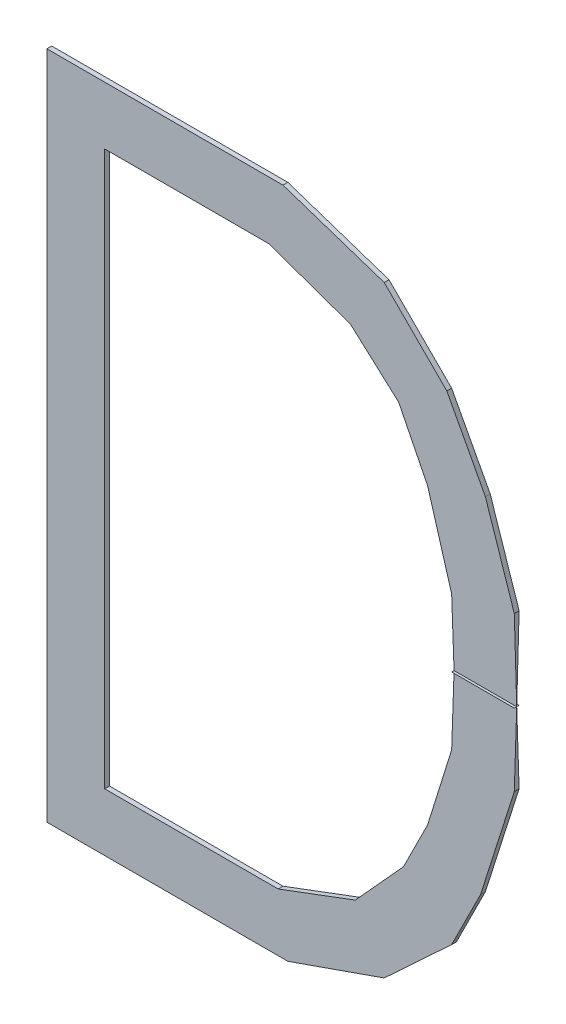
ISO-10303-21;
HEADER;
FILE_DESCRIPTION(('STEP AP214'),'2;1');
FILE_NAME('part.step','',(''),(''),'','','');
FILE_SCHEMA(('AUTOMOTIVE_DESIGN { 1 0 10303 214 1 1 1 1 }'));
ENDSEC;
DATA;
#1=APPLICATION_CONTEXT('core data for automotive mechanical design processes');
#2=APPLICATION_PROTOCOL_DEFINITION('international standard','automotive_design',2000,#1);
#3=PRODUCT_CONTEXT('',#1,'mechanical');
#4=PRODUCT('Part','Part','',(#3));
#5=PRODUCT_RELATED_PRODUCT_CATEGORY('part','',(#4));
#6=PRODUCT_DEFINITION_FORMATION('','',#4);
#7=PRODUCT_DEFINITION_CONTEXT('part definition',#1,'design');
#8=PRODUCT_DEFINITION('design','',#6,#7);
#9=PRODUCT_DEFINITION_SHAPE('','',#8);
#10=(LENGTH_UNIT() NAMED_UNIT(*) SI_UNIT(.MILLI.,.METRE.));
#11=(NAMED_UNIT(*) PLANE_ANGLE_UNIT() SI_UNIT($,.RADIAN.));
#12=(NAMED_UNIT(*) SI_UNIT($,.STERADIAN.) SOLID_ANGLE_UNIT());
#13=UNCERTAINTY_MEASURE_WITH_UNIT(LENGTH_MEASURE(1.E-05),#10,'distance_accuracy_value','');
#14=(GEOMETRIC_REPRESENTATION_CONTEXT(3) GLOBAL_UNCERTAINTY_ASSIGNED_CONTEXT((#13)) GLOBAL_UNIT_ASSIGNED_CONTEXT((#10,
#11,#12)) REPRESENTATION_CONTEXT('',''));
#15=CARTESIAN_POINT('',(0.,0.,0.));
#16=DIRECTION('',(0.,0.,1.));
#17=DIRECTION('',(1.,0.,0.));
#18=AXIS2_PLACEMENT_3D('',#15,#16,#17);
#19=CARTESIAN_POINT('',(-0.4850003,-0.69499988,0.01));
#20=DIRECTION('',(0.,0.,1.));
#21=DIRECTION('',(1.,0.,0.));
#22=AXIS2_PLACEMENT_3D('',#19,#20,#21);
#23=PLANE('',#22);
#24=DIRECTION('',(0.447213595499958,0.894427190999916,0.));
#25=VECTOR('',#24,1.);
#26=CARTESIAN_POINT('',(0.35500056,-0.49500028,0.01));
#27=LINE('',#26,#25);
#28=CARTESIAN_POINT('',(0.35500056,-0.49500028,0.01));
#29=VERTEX_POINT('',#28);
#30=CARTESIAN_POINT('',(0.415000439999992,-0.375000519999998,0.01));
#31=VERTEX_POINT('',#30);
#32=EDGE_CURVE('P0_E373',#29,#31,#27,.T.);
#33=ORIENTED_EDGE('',*,*,#32,.T.);
#34=DIRECTION('',(0.303203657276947,0.952925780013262,0.));
#35=VECTOR('',#34,1.);
#36=CARTESIAN_POINT('',(0.41500044,-0.37500052,0.01));
#37=LINE('',#36,#35);
#38=CARTESIAN_POINT('',(0.4850003,-0.15500096,0.01));
#39=VERTEX_POINT('',#38);
#40=EDGE_CURVE('P0_E369',#31,#39,#37,.T.);
#41=ORIENTED_EDGE('',*,*,#40,.T.);
#42=DIRECTION('',(0.,1.,0.));
#43=VECTOR('',#42,1.);
#44=CARTESIAN_POINT('',(0.4850003,-0.00500126,0.01));
#45=LINE('',#44,#43);
#46=CARTESIAN_POINT('',(0.4850003,-0.00500125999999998,0.005));
#47=VERTEX_POINT('',#46);
#48=EDGE_CURVE('P0_E224',#47,#39,#45,.F.);
#49=ORIENTED_EDGE('',*,*,#48,.F.);
#50=DIRECTION('',(0.,1.,0.));
#51=VECTOR('',#50,1.);
#52=CARTESIAN_POINT('',(0.4850003,0.1649984,0.01));
#53=LINE('',#52,#51);
#54=CARTESIAN_POINT('',(0.485000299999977,0.164998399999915,0.01));
#55=VERTEX_POINT('',#54);
#56=EDGE_CURVE('P0_E343',#55,#47,#53,.F.);
#57=ORIENTED_EDGE('',*,*,#56,.F.);
#58=DIRECTION('',(-0.316223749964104,0.948684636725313,0.));
#59=VECTOR('',#58,1.);
#60=CARTESIAN_POINT('',(0.42500042,0.34500058,0.01));
#61=LINE('',#60,#59);
#62=CARTESIAN_POINT('',(0.42500041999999,0.345000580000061,0.01));
#63=VERTEX_POINT('',#62);
#64=EDGE_CURVE('P0_E221',#63,#55,#61,.F.);
#65=ORIENTED_EDGE('',*,*,#64,.F.);
#66=DIRECTION('',(-0.470588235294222,0.882352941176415,0.));
#67=VECTOR('',#66,1.);
#68=CARTESIAN_POINT('',(0.34500058,0.49500028,0.01));
#69=LINE('',#68,#67);
#70=CARTESIAN_POINT('',(0.34500058,0.49500028,0.01));
#71=VERTEX_POINT('',#70);
#72=EDGE_CURVE('P0_E218',#71,#63,#69,.F.);
#73=ORIENTED_EDGE('',*,*,#72,.F.);
#74=DIRECTION('',(-0.707106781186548,0.707106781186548,0.));
#75=VECTOR('',#74,1.);
#76=CARTESIAN_POINT('',(0.21500084,0.62500002,0.01));
#77=LINE('',#76,#75);
#78=CARTESIAN_POINT('',(0.21500084,0.62500002,0.01));
#79=VERTEX_POINT('',#78);
#80=EDGE_CURVE('P0_E215',#79,#71,#77,.F.);
#81=ORIENTED_EDGE('',*,*,#80,.F.);
#82=DIRECTION('',(-0.948683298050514,0.316227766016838,0.));
#83=VECTOR('',#82,1.);
#84=CARTESIAN_POINT('',(0.00500126,0.69499988,0.01));
#85=LINE('',#84,#83);
#86=CARTESIAN_POINT('',(0.00500125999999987,0.69499988,0.01));
#87=VERTEX_POINT('',#86);
#88=EDGE_CURVE('P0_E212',#87,#79,#85,.F.);
#89=ORIENTED_EDGE('',*,*,#88,.F.);
#90=DIRECTION('',(1.,0.,0.));
#91=VECTOR('',#90,1.);
#92=CARTESIAN_POINT('',(-0.4850003,0.69499988,0.01));
#93=LINE('',#92,#91);
#94=CARTESIAN_POINT('',(-0.4850003,0.69499988,0.01));
#95=VERTEX_POINT('',#94);
#96=EDGE_CURVE('P0_E193',#95,#87,#93,.T.);
#97=ORIENTED_EDGE('',*,*,#96,.F.);
#98=DIRECTION('',(0.,1.,0.));
#99=VECTOR('',#98,1.);
#100=CARTESIAN_POINT('',(-0.4850003,-0.69499988,0.01));
#101=LINE('',#100,#99);
#102=CARTESIAN_POINT('',(-0.4850003,-0.69499988,0.01));
#103=VERTEX_POINT('',#102);
#104=EDGE_CURVE('P0_E190',#103,#95,#101,.T.);
#105=ORIENTED_EDGE('',*,*,#104,.F.);
#106=DIRECTION('',(1.,0.,0.));
#107=VECTOR('',#106,1.);
#108=CARTESIAN_POINT('',(-0.4850003,-0.69499988,0.01));
#109=LINE('',#108,#107);
#110=CARTESIAN_POINT('',(0.0150012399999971,-0.694999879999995,0.01));
#111=VERTEX_POINT('',#110);
#112=EDGE_CURVE('P0_E20',#103,#111,#109,.T.);
#113=ORIENTED_EDGE('',*,*,#112,.T.);
#114=DIRECTION('',(0.943858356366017,0.330350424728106,0.));
#115=VECTOR('',#114,1.);
#116=CARTESIAN_POINT('',(0.01500124,-0.69499988,0.01));
#117=LINE('',#116,#115);
#118=CARTESIAN_POINT('',(0.21500084,-0.62500002,0.01));
#119=VERTEX_POINT('',#118);
#120=EDGE_CURVE('P0_E188',#111,#119,#117,.T.);
#121=ORIENTED_EDGE('',*,*,#120,.T.);
#122=DIRECTION('',(0.732793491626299,0.680451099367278,0.));
#123=VECTOR('',#122,1.);
#124=CARTESIAN_POINT('',(0.21500084,-0.62500002,0.01));
#125=LINE('',#124,#123);
#126=EDGE_CURVE('P0_E375',#119,#29,#125,.T.);
#127=ORIENTED_EDGE('',*,*,#126,.T.);
#128=EDGE_LOOP('',(#33,#41,#49,#57,#65,#73,#81,#89,#97,#105,#113,#121,#127));
#129=FACE_BOUND('',#128,.T.);
#130=DIRECTION('',(0.282162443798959,-0.95936664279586,0.));
#131=VECTOR('',#130,1.);
#132=CARTESIAN_POINT('',(0.35500056,0.13499846,0.01));
#133=LINE('',#132,#131);
#134=CARTESIAN_POINT('',(0.35500056,0.13499846,0.01));
#135=VERTEX_POINT('',#134);
#136=CARTESIAN_POINT('',(0.305000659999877,0.305000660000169,0.01));
#137=VERTEX_POINT('',#136);
#138=EDGE_CURVE('P0_E228',#135,#137,#133,.F.);
#139=ORIENTED_EDGE('',*,*,#138,.F.);
#140=DIRECTION('',(0.,1.,0.));
#141=VECTOR('',#140,1.);
#142=CARTESIAN_POINT('',(0.35500056,-0.00500126,0.01));
#143=LINE('',#142,#141);
#144=CARTESIAN_POINT('',(0.35500056,-0.00500125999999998,0.005));
#145=VERTEX_POINT('',#144);
#146=EDGE_CURVE('P0_E225',#145,#135,#143,.T.);
#147=ORIENTED_EDGE('',*,*,#146,.F.);
#148=DIRECTION('',(0.,1.,0.));
#149=VECTOR('',#148,1.);
#150=CARTESIAN_POINT('',(0.35500056,-0.14500098,0.01));
#151=LINE('',#150,#149);
#152=CARTESIAN_POINT('',(0.355000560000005,-0.145000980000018,0.01));
#153=VERTEX_POINT('',#152);
#154=EDGE_CURVE('P0_E366',#153,#145,#151,.T.);
#155=ORIENTED_EDGE('',*,*,#154,.F.);
#156=DIRECTION('',(-0.298274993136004,-0.954479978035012,0.));
#157=VECTOR('',#156,1.);
#158=CARTESIAN_POINT('',(0.30500066,-0.30500066,0.01));
#159=LINE('',#158,#157);
#160=CARTESIAN_POINT('',(0.30500066,-0.30500066,0.01));
#161=VERTEX_POINT('',#160);
#162=EDGE_CURVE('P0_E257',#161,#153,#159,.F.);
#163=ORIENTED_EDGE('',*,*,#162,.F.);
#164=DIRECTION('',(-0.447213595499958,-0.894427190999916,0.));
#165=VECTOR('',#164,1.);
#166=CARTESIAN_POINT('',(0.25500076,-0.40500046,0.01));
#167=LINE('',#166,#165);
#168=CARTESIAN_POINT('',(0.255000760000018,-0.405000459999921,0.01));
#169=VERTEX_POINT('',#168);
#170=EDGE_CURVE('P0_E255',#169,#161,#167,.F.);
#171=ORIENTED_EDGE('',*,*,#170,.F.);
#172=DIRECTION('',(-0.672672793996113,-0.739940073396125,0.));
#173=VECTOR('',#172,1.);
#174=CARTESIAN_POINT('',(0.15500096,-0.51500024,0.01));
#175=LINE('',#174,#173);
#176=CARTESIAN_POINT('',(0.155000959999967,-0.515000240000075,0.01));
#177=VERTEX_POINT('',#176);
#178=EDGE_CURVE('P0_E252',#177,#169,#175,.F.);
#179=ORIENTED_EDGE('',*,*,#178,.F.);
#180=DIRECTION('',(-0.936329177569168,-0.351123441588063,0.));
#181=VECTOR('',#180,1.);
#182=CARTESIAN_POINT('',(-0.004998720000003,-0.57500012,0.01));
#183=LINE('',#182,#181);
#184=CARTESIAN_POINT('',(-0.00499872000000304,-0.57500012,0.01));
#185=VERTEX_POINT('',#184);
#186=EDGE_CURVE('P0_E249',#185,#177,#183,.F.);
#187=ORIENTED_EDGE('',*,*,#186,.F.);
#188=DIRECTION('',(1.,0.,0.));
#189=VECTOR('',#188,1.);
#190=CARTESIAN_POINT('',(-0.36500054,-0.57500012,0.01));
#191=LINE('',#190,#189);
#192=CARTESIAN_POINT('',(-0.36500054,-0.57500012,0.01));
#193=VERTEX_POINT('',#192);
#194=EDGE_CURVE('P0_E246',#193,#185,#191,.T.);
#195=ORIENTED_EDGE('',*,*,#194,.F.);
#196=DIRECTION('',(0.,1.,0.));
#197=VECTOR('',#196,1.);
#198=CARTESIAN_POINT('',(-0.36500054,0.57500012,0.01));
#199=LINE('',#198,#197);
#200=CARTESIAN_POINT('',(-0.36500054,0.57500012,0.01));
#201=VERTEX_POINT('',#200);
#202=EDGE_CURVE('P0_E243',#201,#193,#199,.F.);
#203=ORIENTED_EDGE('',*,*,#202,.F.);
#204=DIRECTION('',(1.,0.,0.));
#205=VECTOR('',#204,1.);
#206=CARTESIAN_POINT('',(-0.02499868,0.57500012,0.01));
#207=LINE('',#206,#205);
#208=CARTESIAN_POINT('',(-0.0249986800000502,0.575000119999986,0.01));
#209=VERTEX_POINT('',#208);
#210=EDGE_CURVE('P0_E240',#209,#201,#207,.F.);
#211=ORIENTED_EDGE('',*,*,#210,.F.);
#212=DIRECTION('',(0.942990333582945,-0.332820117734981,0.));
#213=VECTOR('',#212,1.);
#214=CARTESIAN_POINT('',(0.14500098,0.51500024,0.01));
#215=LINE('',#214,#213);
#216=CARTESIAN_POINT('',(0.145000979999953,0.515000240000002,0.01));
#217=VERTEX_POINT('',#216);
#218=EDGE_CURVE('P0_E237',#217,#209,#215,.F.);
#219=ORIENTED_EDGE('',*,*,#218,.F.);
#220=DIRECTION('',(0.743294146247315,-0.668964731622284,0.));
#221=VECTOR('',#220,1.);
#222=CARTESIAN_POINT('',(0.24500078,0.42500042,0.01));
#223=LINE('',#222,#221);
#224=CARTESIAN_POINT('',(0.24500078,0.42500042,0.01));
#225=VERTEX_POINT('',#224);
#226=EDGE_CURVE('P0_E234',#225,#217,#223,.F.);
#227=ORIENTED_EDGE('',*,*,#226,.F.);
#228=DIRECTION('',(0.447213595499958,-0.894427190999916,0.));
#229=VECTOR('',#228,1.);
#230=CARTESIAN_POINT('',(0.30500066,0.30500066,0.01));
#231=LINE('',#230,#229);
#232=EDGE_CURVE('P0_E231',#137,#225,#231,.F.);
#233=ORIENTED_EDGE('',*,*,#232,.F.);
#234=EDGE_LOOP('',(#139,#147,#155,#163,#171,#179,#187,#195,#203,#211,#219,#227,#233));
#235=FACE_BOUND('',#234,.T.);
#236=ADVANCED_FACE('P0_F17',(#129,#235),#23,.T.);
#237=CARTESIAN_POINT('',(0.35500056,-0.14500098,0.));
#238=DIRECTION('',(-1.,0.,0.));
#239=DIRECTION('',(0.,0.,1.));
#240=AXIS2_PLACEMENT_3D('',#237,#238,#239);
#241=PLANE('',#240);
#242=DIRECTION('',(0.,1.,0.));
#243=VECTOR('',#242,1.);
#244=CARTESIAN_POINT('',(0.35500056,-0.14500098,0.));
#245=LINE('',#244,#243);
#246=CARTESIAN_POINT('',(0.355000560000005,-0.145000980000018,0.));
#247=VERTEX_POINT('',#246);
#248=EDGE_CURVE('P0_E333',#145,#247,#245,.F.);
#249=ORIENTED_EDGE('',*,*,#248,.T.);
#250=DIRECTION('',(0.,0.,1.));
#251=VECTOR('',#250,1.);
#252=CARTESIAN_POINT('',(0.35500056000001,-0.145000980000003,0.));
#253=LINE('',#252,#251);
#254=EDGE_CURVE('P0_E256',#153,#247,#253,.F.);
#255=ORIENTED_EDGE('',*,*,#254,.F.);
#256=ORIENTED_EDGE('',*,*,#154,.T.);
#257=EDGE_LOOP('',(#249,#255,#256));
#258=FACE_BOUND('',#257,.T.);
#259=ADVANCED_FACE('P0_F650',(#258),#241,.T.);
#260=CARTESIAN_POINT('',(0.30500066,-0.30500066,0.));
#261=DIRECTION('',(-0.954479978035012,0.298274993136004,0.));
#262=DIRECTION('',(-0.298274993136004,-0.954479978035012,0.));
#263=AXIS2_PLACEMENT_3D('',#260,#261,#262);
#264=PLANE('',#263);
#265=ORIENTED_EDGE('',*,*,#254,.T.);
#266=DIRECTION('',(-0.298274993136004,-0.954479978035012,0.));
#267=VECTOR('',#266,1.);
#268=CARTESIAN_POINT('',(0.30500066,-0.30500066,0.));
#269=LINE('',#268,#267);
#270=CARTESIAN_POINT('',(0.30500066,-0.30500066,0.));
#271=VERTEX_POINT('',#270);
#272=EDGE_CURVE('P0_E330',#247,#271,#269,.T.);
#273=ORIENTED_EDGE('',*,*,#272,.T.);
#274=DIRECTION('',(0.,0.,1.));
#275=VECTOR('',#274,1.);
#276=CARTESIAN_POINT('',(0.30500066,-0.30500066,0.));
#277=LINE('',#276,#275);
#278=EDGE_CURVE('P0_E253',#161,#271,#277,.F.);
#279=ORIENTED_EDGE('',*,*,#278,.F.);
#280=ORIENTED_EDGE('',*,*,#162,.T.);
#281=EDGE_LOOP('',(#265,#273,#279,#280));
#282=FACE_BOUND('',#281,.T.);
#283=ADVANCED_FACE('P0_F641',(#282),#264,.T.);
#284=CARTESIAN_POINT('',(0.25500076,-0.40500046,0.));
#285=DIRECTION('',(-0.894427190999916,0.447213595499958,0.));
#286=DIRECTION('',(-0.447213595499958,-0.894427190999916,0.));
#287=AXIS2_PLACEMENT_3D('',#284,#285,#286);
#288=PLANE('',#287);
#289=ORIENTED_EDGE('',*,*,#278,.T.);
#290=DIRECTION('',(-0.447213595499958,-0.894427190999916,0.));
#291=VECTOR('',#290,1.);
#292=CARTESIAN_POINT('',(0.25500076,-0.40500046,0.));
#293=LINE('',#292,#291);
#294=CARTESIAN_POINT('',(0.255000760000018,-0.405000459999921,0.));
#295=VERTEX_POINT('',#294);
#296=EDGE_CURVE('P0_E327',#271,#295,#293,.T.);
#297=ORIENTED_EDGE('',*,*,#296,.T.);
#298=DIRECTION('',(0.,0.,1.));
#299=VECTOR('',#298,1.);
#300=CARTESIAN_POINT('',(0.25500075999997,-0.405000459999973,0.));
#301=LINE('',#300,#299);
#302=EDGE_CURVE('P0_E250',#169,#295,#301,.F.);
#303=ORIENTED_EDGE('',*,*,#302,.F.);
#304=ORIENTED_EDGE('',*,*,#170,.T.);
#305=EDGE_LOOP('',(#289,#297,#303,#304));
#306=FACE_BOUND('',#305,.T.);
#307=ADVANCED_FACE('P0_F632',(#306),#288,.T.);
#308=CARTESIAN_POINT('',(0.15500096,-0.51500024,0.));
#309=DIRECTION('',(-0.739940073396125,0.672672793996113,0.));
#310=DIRECTION('',(-0.672672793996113,-0.739940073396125,0.));
#311=AXIS2_PLACEMENT_3D('',#308,#309,#310);
#312=PLANE('',#311);
#313=ORIENTED_EDGE('',*,*,#302,.T.);
#314=DIRECTION('',(-0.672672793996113,-0.739940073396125,0.));
#315=VECTOR('',#314,1.);
#316=CARTESIAN_POINT('',(0.15500096,-0.51500024,0.));
#317=LINE('',#316,#315);
#318=CARTESIAN_POINT('',(0.155000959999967,-0.515000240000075,0.));
#319=VERTEX_POINT('',#318);
#320=EDGE_CURVE('P0_E324',#295,#319,#317,.T.);
#321=ORIENTED_EDGE('',*,*,#320,.T.);
#322=DIRECTION('',(0.,0.,1.));
#323=VECTOR('',#322,1.);
#324=CARTESIAN_POINT('',(0.155000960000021,-0.515000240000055,0.));
#325=LINE('',#324,#323);
#326=EDGE_CURVE('P0_E247',#177,#319,#325,.F.);
#327=ORIENTED_EDGE('',*,*,#326,.F.);
#328=ORIENTED_EDGE('',*,*,#178,.T.);
#329=EDGE_LOOP('',(#313,#321,#327,#328));
#330=FACE_BOUND('',#329,.T.);
#331=ADVANCED_FACE('P0_F623',(#330),#312,.T.);
#332=CARTESIAN_POINT('',(-0.004998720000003,-0.57500012,0.));
#333=DIRECTION('',(-0.351123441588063,0.936329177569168,0.));
#334=DIRECTION('',(-0.936329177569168,-0.351123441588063,0.));
#335=AXIS2_PLACEMENT_3D('',#332,#333,#334);
#336=PLANE('',#335);
#337=ORIENTED_EDGE('',*,*,#326,.T.);
#338=DIRECTION('',(-0.936329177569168,-0.351123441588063,0.));
#339=VECTOR('',#338,1.);
#340=CARTESIAN_POINT('',(-0.004998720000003,-0.57500012,0.));
#341=LINE('',#340,#339);
#342=CARTESIAN_POINT('',(-0.00499872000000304,-0.57500012,0.));
#343=VERTEX_POINT('',#342);
#344=EDGE_CURVE('P0_E321',#319,#343,#341,.T.);
#345=ORIENTED_EDGE('',*,*,#344,.T.);
#346=DIRECTION('',(0.,0.,1.));
#347=VECTOR('',#346,1.);
#348=CARTESIAN_POINT('',(-0.00499872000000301,-0.57500012,0.));
#349=LINE('',#348,#347);
#350=EDGE_CURVE('P0_E244',#185,#343,#349,.F.);
#351=ORIENTED_EDGE('',*,*,#350,.F.);
#352=ORIENTED_EDGE('',*,*,#186,.T.);
#353=EDGE_LOOP('',(#337,#345,#351,#352));
#354=FACE_BOUND('',#353,.T.);
#355=ADVANCED_FACE('P0_F614',(#354),#336,.T.);
#356=CARTESIAN_POINT('',(-0.36500054,-0.57500012,0.));
#357=DIRECTION('',(0.,1.,0.));
#358=DIRECTION('',(0.,0.,1.));
#359=AXIS2_PLACEMENT_3D('',#356,#357,#358);
#360=PLANE('',#359);
#361=ORIENTED_EDGE('',*,*,#350,.T.);
#362=DIRECTION('',(1.,0.,0.));
#363=VECTOR('',#362,1.);
#364=CARTESIAN_POINT('',(-0.36500054,-0.57500012,0.));
#365=LINE('',#364,#363);
#366=CARTESIAN_POINT('',(-0.36500054,-0.57500012,0.));
#367=VERTEX_POINT('',#366);
#368=EDGE_CURVE('P0_E318',#343,#367,#365,.F.);
#369=ORIENTED_EDGE('',*,*,#368,.T.);
#370=DIRECTION('',(0.,0.,-1.));
#371=VECTOR('',#370,1.);
#372=CARTESIAN_POINT('',(-0.36500054,-0.57500012,0.));
#373=LINE('',#372,#371);
#374=EDGE_CURVE('P0_E241',#193,#367,#373,.T.);
#375=ORIENTED_EDGE('',*,*,#374,.F.);
#376=ORIENTED_EDGE('',*,*,#194,.T.);
#377=EDGE_LOOP('',(#361,#369,#375,#376));
#378=FACE_BOUND('',#377,.T.);
#379=ADVANCED_FACE('P0_F605',(#378),#360,.T.);
#380=CARTESIAN_POINT('',(-0.36500054,0.57500012,0.));
#381=DIRECTION('',(1.,0.,0.));
#382=DIRECTION('',(0.,0.,-1.));
#383=AXIS2_PLACEMENT_3D('',#380,#381,#382);
#384=PLANE('',#383);
#385=ORIENTED_EDGE('',*,*,#374,.T.);
#386=DIRECTION('',(0.,1.,0.));
#387=VECTOR('',#386,1.);
#388=CARTESIAN_POINT('',(-0.36500054,0.57500012,0.));
#389=LINE('',#388,#387);
#390=CARTESIAN_POINT('',(-0.36500054,0.57500012,0.));
#391=VERTEX_POINT('',#390);
#392=EDGE_CURVE('P0_E315',#367,#391,#389,.T.);
#393=ORIENTED_EDGE('',*,*,#392,.T.);
#394=DIRECTION('',(0.,0.,-1.));
#395=VECTOR('',#394,1.);
#396=CARTESIAN_POINT('',(-0.36500054,0.57500012,0.));
#397=LINE('',#396,#395);
#398=EDGE_CURVE('P0_E238',#201,#391,#397,.T.);
#399=ORIENTED_EDGE('',*,*,#398,.F.);
#400=ORIENTED_EDGE('',*,*,#202,.T.);
#401=EDGE_LOOP('',(#385,#393,#399,#400));
#402=FACE_BOUND('',#401,.T.);
#403=ADVANCED_FACE('P0_F596',(#402),#384,.T.);
#404=CARTESIAN_POINT('',(-0.02499868,0.57500012,0.));
#405=DIRECTION('',(0.,-1.,0.));
#406=DIRECTION('',(0.,0.,-1.));
#407=AXIS2_PLACEMENT_3D('',#404,#405,#406);
#408=PLANE('',#407);
#409=ORIENTED_EDGE('',*,*,#398,.T.);
#410=DIRECTION('',(1.,0.,0.));
#411=VECTOR('',#410,1.);
#412=CARTESIAN_POINT('',(-0.02499868,0.57500012,0.));
#413=LINE('',#412,#411);
#414=CARTESIAN_POINT('',(-0.0249986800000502,0.575000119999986,0.));
#415=VERTEX_POINT('',#414);
#416=EDGE_CURVE('P0_E312',#391,#415,#413,.T.);
#417=ORIENTED_EDGE('',*,*,#416,.T.);
#418=DIRECTION('',(0.,0.,1.));
#419=VECTOR('',#418,1.);
#420=CARTESIAN_POINT('',(-0.02499868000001,0.575000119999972,0.));
#421=LINE('',#420,#419);
#422=EDGE_CURVE('P0_E235',#209,#415,#421,.F.);
#423=ORIENTED_EDGE('',*,*,#422,.F.);
#424=ORIENTED_EDGE('',*,*,#210,.T.);
#425=EDGE_LOOP('',(#409,#417,#423,#424));
#426=FACE_BOUND('',#425,.T.);
#427=ADVANCED_FACE('P0_F587',(#426),#408,.T.);
#428=CARTESIAN_POINT('',(0.14500098,0.51500024,0.));
#429=DIRECTION('',(-0.332820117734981,-0.942990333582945,0.));
#430=DIRECTION('',(0.942990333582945,-0.332820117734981,0.));
#431=AXIS2_PLACEMENT_3D('',#428,#429,#430);
#432=PLANE('',#431);
#433=ORIENTED_EDGE('',*,*,#422,.T.);
#434=DIRECTION('',(0.942990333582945,-0.332820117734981,0.));
#435=VECTOR('',#434,1.);
#436=CARTESIAN_POINT('',(0.14500098,0.51500024,0.));
#437=LINE('',#436,#435);
#438=CARTESIAN_POINT('',(0.145000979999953,0.515000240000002,0.));
#439=VERTEX_POINT('',#438);
#440=EDGE_CURVE('P0_E309',#415,#439,#437,.T.);
#441=ORIENTED_EDGE('',*,*,#440,.T.);
#442=DIRECTION('',(0.,0.,1.));
#443=VECTOR('',#442,1.);
#444=CARTESIAN_POINT('',(0.14500097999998,0.515000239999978,0.));
#445=LINE('',#444,#443);
#446=EDGE_CURVE('P0_E232',#217,#439,#445,.F.);
#447=ORIENTED_EDGE('',*,*,#446,.F.);
#448=ORIENTED_EDGE('',*,*,#218,.T.);
#449=EDGE_LOOP('',(#433,#441,#447,#448));
#450=FACE_BOUND('',#449,.T.);
#451=ADVANCED_FACE('P0_F578',(#450),#432,.T.);
#452=CARTESIAN_POINT('',(0.24500078,0.42500042,0.));
#453=DIRECTION('',(-0.668964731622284,-0.743294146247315,0.));
#454=DIRECTION('',(0.743294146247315,-0.668964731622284,0.));
#455=AXIS2_PLACEMENT_3D('',#452,#453,#454);
#456=PLANE('',#455);
#457=ORIENTED_EDGE('',*,*,#446,.T.);
#458=DIRECTION('',(0.743294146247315,-0.668964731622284,0.));
#459=VECTOR('',#458,1.);
#460=CARTESIAN_POINT('',(0.24500078,0.42500042,0.));
#461=LINE('',#460,#459);
#462=CARTESIAN_POINT('',(0.24500078,0.42500042,0.));
#463=VERTEX_POINT('',#462);
#464=EDGE_CURVE('P0_E306',#439,#463,#461,.T.);
#465=ORIENTED_EDGE('',*,*,#464,.T.);
#466=DIRECTION('',(0.,0.,1.));
#467=VECTOR('',#466,1.);
#468=CARTESIAN_POINT('',(0.24500078,0.42500042,0.));
#469=LINE('',#468,#467);
#470=EDGE_CURVE('P0_E229',#225,#463,#469,.F.);
#471=ORIENTED_EDGE('',*,*,#470,.F.);
#472=ORIENTED_EDGE('',*,*,#226,.T.);
#473=EDGE_LOOP('',(#457,#465,#471,#472));
#474=FACE_BOUND('',#473,.T.);
#475=ADVANCED_FACE('P0_F569',(#474),#456,.T.);
#476=CARTESIAN_POINT('',(0.30500066,0.30500066,0.));
#477=DIRECTION('',(-0.894427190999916,-0.447213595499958,0.));
#478=DIRECTION('',(0.447213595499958,-0.894427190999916,0.));
#479=AXIS2_PLACEMENT_3D('',#476,#477,#478);
#480=PLANE('',#479);
#481=ORIENTED_EDGE('',*,*,#470,.T.);
#482=DIRECTION('',(0.447213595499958,-0.894427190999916,0.));
#483=VECTOR('',#482,1.);
#484=CARTESIAN_POINT('',(0.30500066,0.30500066,0.));
#485=LINE('',#484,#483);
#486=CARTESIAN_POINT('',(0.305000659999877,0.305000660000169,0.));
#487=VERTEX_POINT('',#486);
#488=EDGE_CURVE('P0_E303',#463,#487,#485,.T.);
#489=ORIENTED_EDGE('',*,*,#488,.T.);
#490=DIRECTION('',(0.,0.,1.));
#491=VECTOR('',#490,1.);
#492=CARTESIAN_POINT('',(0.305000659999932,0.30500065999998,0.));
#493=LINE('',#492,#491);
#494=EDGE_CURVE('P0_E226',#137,#487,#493,.F.);
#495=ORIENTED_EDGE('',*,*,#494,.F.);
#496=ORIENTED_EDGE('',*,*,#232,.T.);
#497=EDGE_LOOP('',(#481,#489,#495,#496));
#498=FACE_BOUND('',#497,.T.);
#499=ADVANCED_FACE('P0_F560',(#498),#480,.T.);
#500=CARTESIAN_POINT('',(0.35500056,0.13499846,0.));
#501=DIRECTION('',(-0.95936664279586,-0.282162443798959,0.));
#502=DIRECTION('',(0.282162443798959,-0.95936664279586,0.));
#503=AXIS2_PLACEMENT_3D('',#500,#501,#502);
#504=PLANE('',#503);
#505=ORIENTED_EDGE('',*,*,#494,.T.);
#506=DIRECTION('',(0.282162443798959,-0.95936664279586,0.));
#507=VECTOR('',#506,1.);
#508=CARTESIAN_POINT('',(0.35500056,0.13499846,0.));
#509=LINE('',#508,#507);
#510=CARTESIAN_POINT('',(0.35500056,0.13499846,0.));
#511=VERTEX_POINT('',#510);
#512=EDGE_CURVE('P0_E298',#487,#511,#509,.T.);
#513=ORIENTED_EDGE('',*,*,#512,.T.);
#514=DIRECTION('',(0.,0.,1.));
#515=VECTOR('',#514,1.);
#516=CARTESIAN_POINT('',(0.35500056,0.13499846,0.));
#517=LINE('',#516,#515);
#518=EDGE_CURVE('P0_E222',#135,#511,#517,.F.);
#519=ORIENTED_EDGE('',*,*,#518,.F.);
#520=ORIENTED_EDGE('',*,*,#138,.T.);
#521=EDGE_LOOP('',(#505,#513,#519,#520));
#522=FACE_BOUND('',#521,.T.);
#523=ADVANCED_FACE('P0_F551',(#522),#504,.T.);
#524=CARTESIAN_POINT('',(0.35500056,-0.00500126,0.));
#525=DIRECTION('',(-1.,0.,0.));
#526=DIRECTION('',(0.,0.,1.));
#527=AXIS2_PLACEMENT_3D('',#524,#525,#526);
#528=PLANE('',#527);
#529=ORIENTED_EDGE('',*,*,#518,.T.);
#530=DIRECTION('',(0.,1.,0.));
#531=VECTOR('',#530,1.);
#532=CARTESIAN_POINT('',(0.35500056,-0.00500126,0.));
#533=LINE('',#532,#531);
#534=EDGE_CURVE('P0_E293',#511,#145,#533,.F.);
#535=ORIENTED_EDGE('',*,*,#534,.T.);
#536=ORIENTED_EDGE('',*,*,#146,.T.);
#537=EDGE_LOOP('',(#529,#535,#536));
#538=FACE_BOUND('',#537,.T.);
#539=ADVANCED_FACE('P0_F543',(#538),#528,.T.);
#540=CARTESIAN_POINT('',(0.4850003,-0.00500126,0.));
#541=DIRECTION('',(1.,0.,0.));
#542=DIRECTION('',(0.,0.,-1.));
#543=AXIS2_PLACEMENT_3D('',#540,#541,#542);
#544=PLANE('',#543);
#545=DIRECTION('',(0.,0.,1.));
#546=VECTOR('',#545,1.);
#547=CARTESIAN_POINT('',(0.4850003,-0.15500096,0.));
#548=LINE('',#547,#546);
#549=CARTESIAN_POINT('',(0.4850003,-0.15500096,0.));
#550=VERTEX_POINT('',#549);
#551=EDGE_CURVE('P0_E389',#550,#39,#548,.T.);
#552=ORIENTED_EDGE('',*,*,#551,.F.);
#553=DIRECTION('',(0.,1.,0.));
#554=VECTOR('',#553,1.);
#555=CARTESIAN_POINT('',(0.4850003,-0.00500126,0.));
#556=LINE('',#555,#554);
#557=EDGE_CURVE('P0_E288',#550,#47,#556,.T.);
#558=ORIENTED_EDGE('',*,*,#557,.T.);
#559=ORIENTED_EDGE('',*,*,#48,.T.);
#560=EDGE_LOOP('',(#552,#558,#559));
#561=FACE_BOUND('',#560,.T.);
#562=ADVANCED_FACE('P0_F398',(#561),#544,.T.);
#563=CARTESIAN_POINT('',(0.4850003,0.1649984,0.));
#564=DIRECTION('',(1.,0.,0.));
#565=DIRECTION('',(0.,0.,-1.));
#566=AXIS2_PLACEMENT_3D('',#563,#564,#565);
#567=PLANE('',#566);
#568=DIRECTION('',(0.,1.,0.));
#569=VECTOR('',#568,1.);
#570=CARTESIAN_POINT('',(0.4850003,0.1649984,0.));
#571=LINE('',#570,#569);
#572=CARTESIAN_POINT('',(0.485000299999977,0.164998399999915,0.));
#573=VERTEX_POINT('',#572);
#574=EDGE_CURVE('P0_E285',#47,#573,#571,.T.);
#575=ORIENTED_EDGE('',*,*,#574,.T.);
#576=DIRECTION('',(0.,0.,1.));
#577=VECTOR('',#576,1.);
#578=CARTESIAN_POINT('',(0.485000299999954,0.164998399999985,0.));
#579=LINE('',#578,#577);
#580=EDGE_CURVE('P0_E219',#55,#573,#579,.F.);
#581=ORIENTED_EDGE('',*,*,#580,.F.);
#582=ORIENTED_EDGE('',*,*,#56,.T.);
#583=EDGE_LOOP('',(#575,#581,#582));
#584=FACE_BOUND('',#583,.T.);
#585=ADVANCED_FACE('P0_F409',(#584),#567,.T.);
#586=CARTESIAN_POINT('',(0.42500042,0.34500058,0.));
#587=DIRECTION('',(0.948684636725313,0.316223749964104,0.));
#588=DIRECTION('',(-0.316223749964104,0.948684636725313,0.));
#589=AXIS2_PLACEMENT_3D('',#586,#587,#588);
#590=PLANE('',#589);
#591=ORIENTED_EDGE('',*,*,#580,.T.);
#592=DIRECTION('',(-0.316223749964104,0.948684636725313,0.));
#593=VECTOR('',#592,1.);
#594=CARTESIAN_POINT('',(0.42500042,0.34500058,0.));
#595=LINE('',#594,#593);
#596=CARTESIAN_POINT('',(0.42500041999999,0.345000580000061,0.));
#597=VERTEX_POINT('',#596);
#598=EDGE_CURVE('P0_E282',#573,#597,#595,.T.);
#599=ORIENTED_EDGE('',*,*,#598,.T.);
#600=DIRECTION('',(0.,0.,1.));
#601=VECTOR('',#600,1.);
#602=CARTESIAN_POINT('',(0.425000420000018,0.345000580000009,0.));
#603=LINE('',#602,#601);
#604=EDGE_CURVE('P0_E216',#63,#597,#603,.F.);
#605=ORIENTED_EDGE('',*,*,#604,.F.);
#606=ORIENTED_EDGE('',*,*,#64,.T.);
#607=EDGE_LOOP('',(#591,#599,#605,#606));
#608=FACE_BOUND('',#607,.T.);
#609=ADVANCED_FACE('P0_F416',(#608),#590,.T.);
#610=CARTESIAN_POINT('',(0.34500058,0.49500028,0.));
#611=DIRECTION('',(0.882352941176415,0.470588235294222,0.));
#612=DIRECTION('',(-0.470588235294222,0.882352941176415,0.));
#613=AXIS2_PLACEMENT_3D('',#610,#611,#612);
#614=PLANE('',#613);
#615=ORIENTED_EDGE('',*,*,#604,.T.);
#616=DIRECTION('',(-0.470588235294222,0.882352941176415,0.));
#617=VECTOR('',#616,1.);
#618=CARTESIAN_POINT('',(0.34500058,0.49500028,0.));
#619=LINE('',#618,#617);
#620=CARTESIAN_POINT('',(0.34500058,0.49500028,0.));
#621=VERTEX_POINT('',#620);
#622=EDGE_CURVE('P0_E279',#597,#621,#619,.T.);
#623=ORIENTED_EDGE('',*,*,#622,.T.);
#624=DIRECTION('',(0.,0.,1.));
#625=VECTOR('',#624,1.);
#626=CARTESIAN_POINT('',(0.34500058,0.49500028,0.));
#627=LINE('',#626,#625);
#628=EDGE_CURVE('P0_E213',#71,#621,#627,.F.);
#629=ORIENTED_EDGE('',*,*,#628,.F.);
#630=ORIENTED_EDGE('',*,*,#72,.T.);
#631=EDGE_LOOP('',(#615,#623,#629,#630));
#632=FACE_BOUND('',#631,.T.);
#633=ADVANCED_FACE('P0_F418',(#632),#614,.T.);
#634=CARTESIAN_POINT('',(0.21500084,0.62500002,0.));
#635=DIRECTION('',(0.707106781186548,0.707106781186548,0.));
#636=DIRECTION('',(-0.707106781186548,0.707106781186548,0.));
#637=AXIS2_PLACEMENT_3D('',#634,#635,#636);
#638=PLANE('',#637);
#639=ORIENTED_EDGE('',*,*,#628,.T.);
#640=DIRECTION('',(-0.707106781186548,0.707106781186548,0.));
#641=VECTOR('',#640,1.);
#642=CARTESIAN_POINT('',(0.21500084,0.62500002,0.));
#643=LINE('',#642,#641);
#644=CARTESIAN_POINT('',(0.21500084,0.62500002,0.));
#645=VERTEX_POINT('',#644);
#646=EDGE_CURVE('P0_E276',#621,#645,#643,.T.);
#647=ORIENTED_EDGE('',*,*,#646,.T.);
#648=DIRECTION('',(0.,0.,1.));
#649=VECTOR('',#648,1.);
#650=CARTESIAN_POINT('',(0.21500084,0.62500002,0.));
#651=LINE('',#650,#649);
#652=EDGE_CURVE('P0_E210',#79,#645,#651,.F.);
#653=ORIENTED_EDGE('',*,*,#652,.F.);
#654=ORIENTED_EDGE('',*,*,#80,.T.);
#655=EDGE_LOOP('',(#639,#647,#653,#654));
#656=FACE_BOUND('',#655,.T.);
#657=ADVANCED_FACE('P0_F424',(#656),#638,.T.);
#658=CARTESIAN_POINT('',(0.00500126,0.69499988,0.));
#659=DIRECTION('',(0.316227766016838,0.948683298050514,0.));
#660=DIRECTION('',(-0.948683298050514,0.316227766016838,0.));
#661=AXIS2_PLACEMENT_3D('',#658,#659,#660);
#662=PLANE('',#661);
#663=ORIENTED_EDGE('',*,*,#652,.T.);
#664=DIRECTION('',(-0.948683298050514,0.316227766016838,0.));
#665=VECTOR('',#664,1.);
#666=CARTESIAN_POINT('',(0.00500126,0.69499988,0.));
#667=LINE('',#666,#665);
#668=CARTESIAN_POINT('',(0.00500125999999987,0.69499988,0.));
#669=VERTEX_POINT('',#668);
#670=EDGE_CURVE('P0_E273',#645,#669,#667,.T.);
#671=ORIENTED_EDGE('',*,*,#670,.T.);
#672=DIRECTION('',(0.,0.,1.));
#673=VECTOR('',#672,1.);
#674=CARTESIAN_POINT('',(0.00500126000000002,0.69499988,0.));
#675=LINE('',#674,#673);
#676=EDGE_CURVE('P0_E197',#87,#669,#675,.F.);
#677=ORIENTED_EDGE('',*,*,#676,.F.);
#678=ORIENTED_EDGE('',*,*,#88,.T.);
#679=EDGE_LOOP('',(#663,#671,#677,#678));
#680=FACE_BOUND('',#679,.T.);
#681=ADVANCED_FACE('P0_F427',(#680),#662,.T.);
#682=CARTESIAN_POINT('',(-0.4850003,0.69499988,0.));
#683=DIRECTION('',(0.,1.,0.));
#684=DIRECTION('',(0.,0.,1.));
#685=AXIS2_PLACEMENT_3D('',#682,#683,#684);
#686=PLANE('',#685);
#687=ORIENTED_EDGE('',*,*,#676,.T.);
#688=DIRECTION('',(1.,0.,0.));
#689=VECTOR('',#688,1.);
#690=CARTESIAN_POINT('',(-0.4850003,0.69499988,0.));
#691=LINE('',#690,#689);
#692=CARTESIAN_POINT('',(-0.4850003,0.69499988,0.));
#693=VERTEX_POINT('',#692);
#694=EDGE_CURVE('P0_E270',#669,#693,#691,.F.);
#695=ORIENTED_EDGE('',*,*,#694,.T.);
#696=DIRECTION('',(0.,0.,1.));
#697=VECTOR('',#696,1.);
#698=CARTESIAN_POINT('',(-0.4850003,0.69499988,0.));
#699=LINE('',#698,#697);
#700=EDGE_CURVE('P0_E196',#95,#693,#699,.F.);
#701=ORIENTED_EDGE('',*,*,#700,.F.);
#702=ORIENTED_EDGE('',*,*,#96,.T.);
#703=EDGE_LOOP('',(#687,#695,#701,#702));
#704=FACE_BOUND('',#703,.T.);
#705=ADVANCED_FACE('P0_F429',(#704),#686,.T.);
#706=CARTESIAN_POINT('',(-0.4850003,-0.69499988,0.));
#707=DIRECTION('',(-1.,0.,0.));
#708=DIRECTION('',(0.,0.,1.));
#709=AXIS2_PLACEMENT_3D('',#706,#707,#708);
#710=PLANE('',#709);
#711=ORIENTED_EDGE('',*,*,#700,.T.);
#712=DIRECTION('',(0.,1.,0.));
#713=VECTOR('',#712,1.);
#714=CARTESIAN_POINT('',(-0.4850003,-0.69499988,0.));
#715=LINE('',#714,#713);
#716=CARTESIAN_POINT('',(-0.4850003,-0.69499988,0.));
#717=VERTEX_POINT('',#716);
#718=EDGE_CURVE('P0_E202',#693,#717,#715,.F.);
#719=ORIENTED_EDGE('',*,*,#718,.T.);
#720=DIRECTION('',(0.,0.,-1.));
#721=VECTOR('',#720,1.);
#722=CARTESIAN_POINT('',(-0.4850003,-0.69499988,0.));
#723=LINE('',#722,#721);
#724=EDGE_CURVE('P0_E183',#103,#717,#723,.T.);
#725=ORIENTED_EDGE('',*,*,#724,.F.);
#726=ORIENTED_EDGE('',*,*,#104,.T.);
#727=EDGE_LOOP('',(#711,#719,#725,#726));
#728=FACE_BOUND('',#727,.T.);
#729=ADVANCED_FACE('P0_F200',(#728),#710,.T.);
#730=CARTESIAN_POINT('',(0.01500124,-0.69499988,0.));
#731=DIRECTION('',(0.,-1.,0.));
#732=DIRECTION('',(0.,0.,-1.));
#733=AXIS2_PLACEMENT_3D('',#730,#731,#732);
#734=PLANE('',#733);
#735=ORIENTED_EDGE('',*,*,#724,.T.);
#736=DIRECTION('',(1.,0.,0.));
#737=VECTOR('',#736,1.);
#738=CARTESIAN_POINT('',(0.01500124,-0.69499988,0.));
#739=LINE('',#738,#737);
#740=CARTESIAN_POINT('',(0.0150012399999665,-0.694999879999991,0.));
#741=VERTEX_POINT('',#740);
#742=EDGE_CURVE('P0_E267',#717,#741,#739,.T.);
#743=ORIENTED_EDGE('',*,*,#742,.T.);
#744=DIRECTION('',(0.,0.,1.));
#745=VECTOR('',#744,1.);
#746=CARTESIAN_POINT('',(0.0150012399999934,-0.694999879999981,0.));
#747=LINE('',#746,#745);
#748=EDGE_CURVE('P0_E185',#111,#741,#747,.F.);
#749=ORIENTED_EDGE('',*,*,#748,.F.);
#750=ORIENTED_EDGE('',*,*,#112,.F.);
#751=EDGE_LOOP('',(#735,#743,#749,#750));
#752=FACE_BOUND('',#751,.T.);
#753=ADVANCED_FACE('P0_F180',(#752),#734,.T.);
#754=CARTESIAN_POINT('',(0.21500084,-0.62500002,0.));
#755=DIRECTION('',(0.330350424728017,-0.943858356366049,0.));
#756=DIRECTION('',(0.943858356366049,0.330350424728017,0.));
#757=AXIS2_PLACEMENT_3D('',#754,#755,#756);
#758=PLANE('',#757);
#759=ORIENTED_EDGE('',*,*,#748,.T.);
#760=DIRECTION('',(0.943858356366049,0.330350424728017,0.));
#761=VECTOR('',#760,1.);
#762=CARTESIAN_POINT('',(0.21500084,-0.62500002,0.));
#763=LINE('',#762,#761);
#764=CARTESIAN_POINT('',(0.21500084,-0.62500002,0.));
#765=VERTEX_POINT('',#764);
#766=EDGE_CURVE('P0_E264',#741,#765,#763,.T.);
#767=ORIENTED_EDGE('',*,*,#766,.T.);
#768=DIRECTION('',(0.,0.,1.));
#769=VECTOR('',#768,1.);
#770=CARTESIAN_POINT('',(0.21500084,-0.62500002,0.));
#771=LINE('',#770,#769);
#772=EDGE_CURVE('P0_E204',#119,#765,#771,.F.);
#773=ORIENTED_EDGE('',*,*,#772,.F.);
#774=ORIENTED_EDGE('',*,*,#120,.F.);
#775=EDGE_LOOP('',(#759,#767,#773,#774));
#776=FACE_BOUND('',#775,.T.);
#777=ADVANCED_FACE('P0_F380',(#776),#758,.T.);
#778=CARTESIAN_POINT('',(0.35500056,-0.49500028,0.));
#779=DIRECTION('',(0.680451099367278,-0.732793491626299,0.));
#780=DIRECTION('',(0.732793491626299,0.680451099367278,0.));
#781=AXIS2_PLACEMENT_3D('',#778,#779,#780);
#782=PLANE('',#781);
#783=ORIENTED_EDGE('',*,*,#772,.T.);
#784=DIRECTION('',(0.732793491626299,0.680451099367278,0.));
#785=VECTOR('',#784,1.);
#786=CARTESIAN_POINT('',(0.35500056,-0.49500028,0.));
#787=LINE('',#786,#785);
#788=CARTESIAN_POINT('',(0.35500056,-0.49500028,0.));
#789=VERTEX_POINT('',#788);
#790=EDGE_CURVE('P0_E261',#765,#789,#787,.T.);
#791=ORIENTED_EDGE('',*,*,#790,.T.);
#792=DIRECTION('',(0.,0.,1.));
#793=VECTOR('',#792,1.);
#794=CARTESIAN_POINT('',(0.35500056,-0.49500028,0.));
#795=LINE('',#794,#793);
#796=EDGE_CURVE('P0_E384',#29,#789,#795,.F.);
#797=ORIENTED_EDGE('',*,*,#796,.F.);
#798=ORIENTED_EDGE('',*,*,#126,.F.);
#799=EDGE_LOOP('',(#783,#791,#797,#798));
#800=FACE_BOUND('',#799,.T.);
#801=ADVANCED_FACE('P0_F385',(#800),#782,.T.);
#802=CARTESIAN_POINT('',(0.41500044,-0.37500052,0.));
#803=DIRECTION('',(0.894427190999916,-0.447213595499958,0.));
#804=DIRECTION('',(0.447213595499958,0.894427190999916,0.));
#805=AXIS2_PLACEMENT_3D('',#802,#803,#804);
#806=PLANE('',#805);
#807=ORIENTED_EDGE('',*,*,#796,.T.);
#808=DIRECTION('',(0.447213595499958,0.894427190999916,0.));
#809=VECTOR('',#808,1.);
#810=CARTESIAN_POINT('',(0.41500044,-0.37500052,0.));
#811=LINE('',#810,#809);
#812=CARTESIAN_POINT('',(0.415000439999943,-0.375000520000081,0.));
#813=VERTEX_POINT('',#812);
#814=EDGE_CURVE('P0_E26',#789,#813,#811,.T.);
#815=ORIENTED_EDGE('',*,*,#814,.T.);
#816=DIRECTION('',(0.,0.,1.));
#817=VECTOR('',#816,1.);
#818=CARTESIAN_POINT('',(0.415000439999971,-0.375000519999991,0.));
#819=LINE('',#818,#817);
#820=EDGE_CURVE('P0_E34',#31,#813,#819,.F.);
#821=ORIENTED_EDGE('',*,*,#820,.F.);
#822=ORIENTED_EDGE('',*,*,#32,.F.);
#823=EDGE_LOOP('',(#807,#815,#821,#822));
#824=FACE_BOUND('',#823,.T.);
#825=ADVANCED_FACE('P0_F391',(#824),#806,.T.);
#826=CARTESIAN_POINT('',(0.4850003,-0.15500096,0.));
#827=DIRECTION('',(0.952925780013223,-0.303203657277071,0.));
#828=DIRECTION('',(0.303203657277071,0.952925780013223,0.));
#829=AXIS2_PLACEMENT_3D('',#826,#827,#828);
#830=PLANE('',#829);
#831=ORIENTED_EDGE('',*,*,#820,.T.);
#832=DIRECTION('',(0.303203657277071,0.952925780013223,0.));
#833=VECTOR('',#832,1.);
#834=CARTESIAN_POINT('',(0.4850003,-0.15500096,0.));
#835=LINE('',#834,#833);
#836=EDGE_CURVE('P0_E11',#813,#550,#835,.T.);
#837=ORIENTED_EDGE('',*,*,#836,.T.);
#838=ORIENTED_EDGE('',*,*,#551,.T.);
#839=ORIENTED_EDGE('',*,*,#40,.F.);
#840=EDGE_LOOP('',(#831,#837,#838,#839));
#841=FACE_BOUND('',#840,.T.);
#842=ADVANCED_FACE('P0_F399',(#841),#830,.T.);
#843=CARTESIAN_POINT('',(-0.4850003,-0.69499988,0.));
#844=DIRECTION('',(0.,0.,1.));
#845=DIRECTION('',(1.,0.,0.));
#846=AXIS2_PLACEMENT_3D('',#843,#844,#845);
#847=PLANE('',#846);
#848=ORIENTED_EDGE('',*,*,#814,.F.);
#849=ORIENTED_EDGE('',*,*,#790,.F.);
#850=ORIENTED_EDGE('',*,*,#766,.F.);
#851=ORIENTED_EDGE('',*,*,#742,.F.);
#852=ORIENTED_EDGE('',*,*,#718,.F.);
#853=ORIENTED_EDGE('',*,*,#694,.F.);
#854=ORIENTED_EDGE('',*,*,#670,.F.);
#855=ORIENTED_EDGE('',*,*,#646,.F.);
#856=ORIENTED_EDGE('',*,*,#622,.F.);
#857=ORIENTED_EDGE('',*,*,#598,.F.);
#858=ORIENTED_EDGE('',*,*,#574,.F.);
#859=ORIENTED_EDGE('',*,*,#557,.F.);
#860=ORIENTED_EDGE('',*,*,#836,.F.);
#861=EDGE_LOOP('',(#848,#849,#850,#851,#852,#853,#854,#855,#856,#857,#858,#859,#860));
#862=FACE_BOUND('',#861,.T.);
#863=ORIENTED_EDGE('',*,*,#512,.F.);
#864=ORIENTED_EDGE('',*,*,#488,.F.);
#865=ORIENTED_EDGE('',*,*,#464,.F.);
#866=ORIENTED_EDGE('',*,*,#440,.F.);
#867=ORIENTED_EDGE('',*,*,#416,.F.);
#868=ORIENTED_EDGE('',*,*,#392,.F.);
#869=ORIENTED_EDGE('',*,*,#368,.F.);
#870=ORIENTED_EDGE('',*,*,#344,.F.);
#871=ORIENTED_EDGE('',*,*,#320,.F.);
#872=ORIENTED_EDGE('',*,*,#296,.F.);
#873=ORIENTED_EDGE('',*,*,#272,.F.);
#874=ORIENTED_EDGE('',*,*,#248,.F.);
#875=ORIENTED_EDGE('',*,*,#534,.F.);
#876=EDGE_LOOP('',(#863,#864,#865,#866,#867,#868,#869,#870,#871,#872,#873,#874,#875));
#877=FACE_BOUND('',#876,.T.);
#878=ADVANCED_FACE('P0_F403',(#862,#877),#847,.F.);
#879=CLOSED_SHELL('',(#236,#259,#283,#307,#331,#355,#379,#403,#427,#451,#475,#499,#523,#539,
#562,#585,#609,#633,#657,#681,#705,#729,#753,#777,#801,#825,#842,#878));
#880=MANIFOLD_SOLID_BREP('P0_B1',#879);
#881=CARTESIAN_POINT('',(0.35500056,-0.00500126,0.));
#882=DIRECTION('',(0.,1.,0.));
#883=DIRECTION('',(0.,0.,1.));
#884=AXIS2_PLACEMENT_3D('',#881,#882,#883);
#885=PLANE('',#884);
#886=DIRECTION('',(0.,0.,1.));
#887=VECTOR('',#886,1.);
#888=CARTESIAN_POINT('',(0.4850003,-0.00500126,0.));
#889=LINE('',#888,#887);
#890=CARTESIAN_POINT('',(0.4850003,-0.00500126,0.01));
#891=VERTEX_POINT('',#890);
#892=CARTESIAN_POINT('',(0.4850003,-0.00500126,0.));
#893=VERTEX_POINT('',#892);
#894=EDGE_CURVE('P1_E24',#891,#893,#889,.F.);
#895=ORIENTED_EDGE('',*,*,#894,.T.);
#896=DIRECTION('',(1.,0.,0.));
#897=VECTOR('',#896,1.);
#898=CARTESIAN_POINT('',(0.35500056,-0.00500126,0.));
#899=LINE('',#898,#897);
#900=CARTESIAN_POINT('',(0.35500056,-0.00500126,0.));
#901=VERTEX_POINT('',#900);
#902=EDGE_CURVE('P1_E11',#893,#901,#899,.F.);
#903=ORIENTED_EDGE('',*,*,#902,.T.);
#904=DIRECTION('',(0.,0.,1.));
#905=VECTOR('',#904,1.);
#906=CARTESIAN_POINT('',(0.35500056,-0.00500126,0.));
#907=LINE('',#906,#905);
#908=CARTESIAN_POINT('',(0.35500056,-0.00500126,0.01));
#909=VERTEX_POINT('',#908);
#910=EDGE_CURVE('P1_E18',#901,#909,#907,.T.);
#911=ORIENTED_EDGE('',*,*,#910,.T.);
#912=DIRECTION('',(1.,0.,0.));
#913=VECTOR('',#912,1.);
#914=CARTESIAN_POINT('',(0.35500056,-0.00500126,0.01));
#915=LINE('',#914,#913);
#916=EDGE_CURVE('P1_E38',#909,#891,#915,.T.);
#917=ORIENTED_EDGE('',*,*,#916,.T.);
#918=EDGE_LOOP('',(#895,#903,#911,#917));
#919=FACE_BOUND('',#918,.T.);
#920=ADVANCED_FACE('P1_F17',(#919),#885,.T.);
#921=OPEN_SHELL('',(#920));
#922=SHELL_BASED_SURFACE_MODEL('P1_B1',(#921));
#923=ADVANCED_BREP_SHAPE_REPRESENTATION('',(#18,#880),#14);
#924=MANIFOLD_SURFACE_SHAPE_REPRESENTATION('',(#18,#922),#14);
#925=SHAPE_REPRESENTATION('',(#18),#14);
#926=SHAPE_DEFINITION_REPRESENTATION(#9,#925);
#927=SHAPE_REPRESENTATION_RELATIONSHIP('','',#925,#923);
#928=SHAPE_REPRESENTATION_RELATIONSHIP('','',#925,#924);
ENDSEC;
END-ISO-10303-21;
